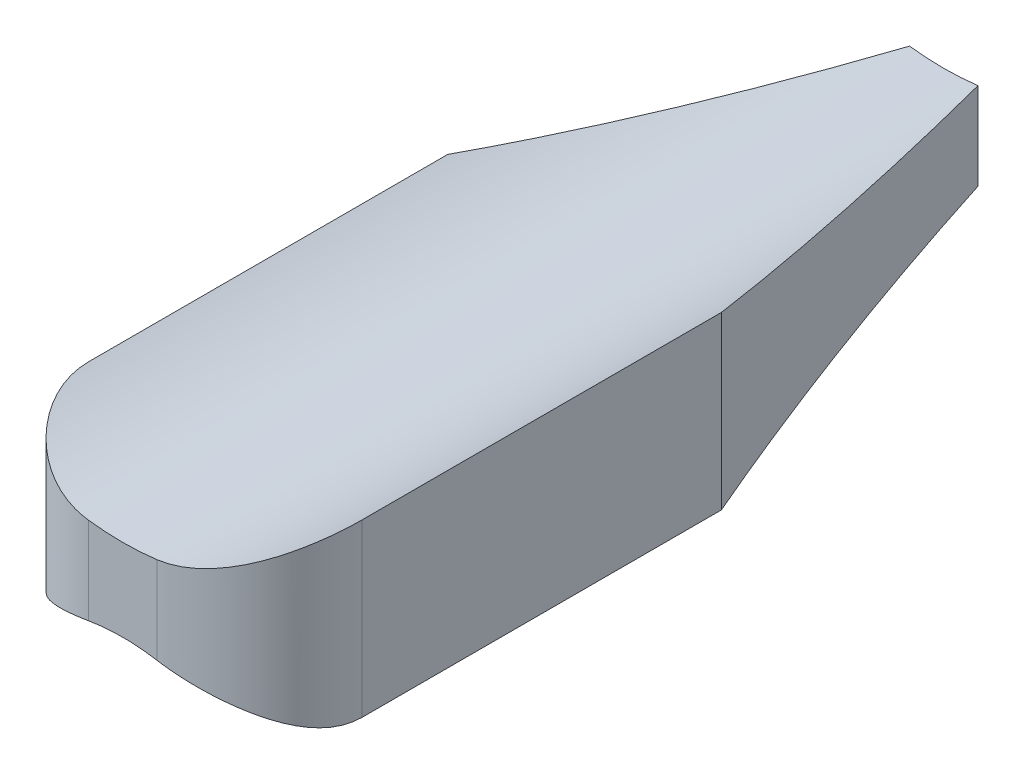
from build123d import *

# Parameters (mm, degrees)
SKETCH1_W           = 101.6
SKETCH1_H           = 63.5
BOSS_EXTRUDE1_DEPTH = 304.8
SKETCH2_R           = 101.6
CUT_EXTRUDE1_DEPTH  = 328.502442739
SKETCH3_R           = 76.2
CUT_EXTRUDE2_DEPTH  = 328.502442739
FILLET1_R           = 38.1
CUT_EXTRUDE3_DEPTH  = 328.502442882


with BuildPart() as part:
    # Sketch1 → Boss-Extrude1 (new body)
    with BuildSketch(Plane.XY):
        with Locations((50.8, 31.75)):
            Rectangle(SKETCH1_W, SKETCH1_H)
    extrude(amount=BOSS_EXTRUDE1_DEPTH)

    # Sketch2 → Cut-Extrude1 (cut, through all)
    with BuildSketch(Plane.XY.offset(304.8)):
        with Locations((50.8, 151.488181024)):
            Circle(SKETCH2_R)
    extrude(amount=-CUT_EXTRUDE1_DEPTH, mode=Mode.SUBTRACT)

    # Sketch3 → Cut-Extrude2 (cut, through all)
    with BuildSketch(Plane.XY.offset(304.8)):
        with Locations((50.8, -56.796126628)):
            Circle(SKETCH3_R)
    extrude(amount=-CUT_EXTRUDE2_DEPTH, mode=Mode.SUBTRACT)

    # Fillet1
    fillet1_edges = [part.edges().sort_by_distance(p)[0] for p in [
        (101.6, 31.75, 304.8),
        (0, 31.75, 304.8),
    ]]
    fillet(fillet1_edges, radius=FILLET1_R)

    # Sketch4 → Cut-Extrude3 (cut, through all)
    with BuildSketch(Plane(origin=(0, 0, 0), x_dir=(1, 0, 0), z_dir=(0, 1, 0))):
        Polygon((0, -133.35), (38.1, 0), (0, 0), align=None)
        Polygon((101.6, -133.35), (63.5, 0), (101.6, 0), align=None)
    extrude(amount=CUT_EXTRUDE3_DEPTH, mode=Mode.SUBTRACT)


solid = part.part
